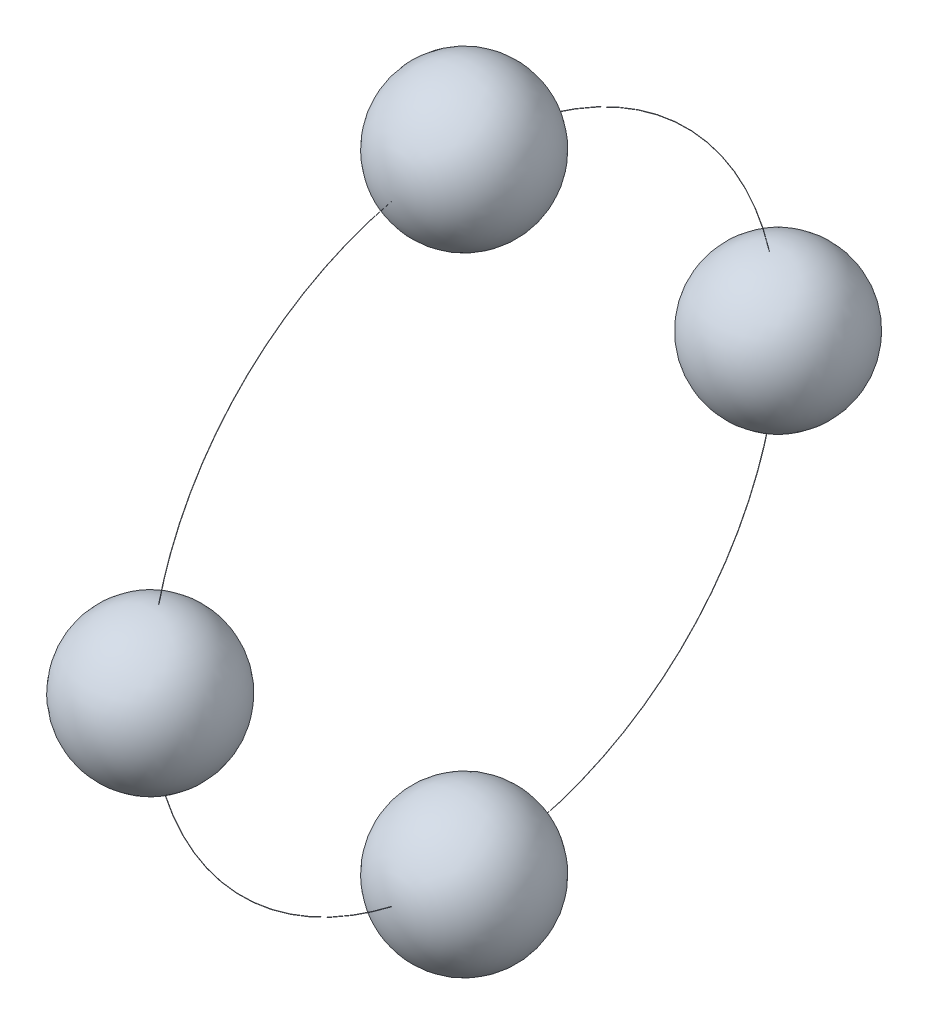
ISO-10303-21;
HEADER;
FILE_DESCRIPTION(('STEP AP214'),'2;1');
FILE_NAME('part.step','',(''),(''),'','','');
FILE_SCHEMA(('AUTOMOTIVE_DESIGN { 1 0 10303 214 1 1 1 1 }'));
ENDSEC;
DATA;
#1=APPLICATION_CONTEXT('core data for automotive mechanical design processes');
#2=APPLICATION_PROTOCOL_DEFINITION('international standard','automotive_design',2000,#1);
#3=PRODUCT_CONTEXT('',#1,'mechanical');
#4=PRODUCT('Part','Part','',(#3));
#5=PRODUCT_RELATED_PRODUCT_CATEGORY('part','',(#4));
#6=PRODUCT_DEFINITION_FORMATION('','',#4);
#7=PRODUCT_DEFINITION_CONTEXT('part definition',#1,'design');
#8=PRODUCT_DEFINITION('design','',#6,#7);
#9=PRODUCT_DEFINITION_SHAPE('','',#8);
#10=(LENGTH_UNIT() NAMED_UNIT(*) SI_UNIT(.MILLI.,.METRE.));
#11=(NAMED_UNIT(*) PLANE_ANGLE_UNIT() SI_UNIT($,.RADIAN.));
#12=(NAMED_UNIT(*) SI_UNIT($,.STERADIAN.) SOLID_ANGLE_UNIT());
#13=UNCERTAINTY_MEASURE_WITH_UNIT(LENGTH_MEASURE(1.E-05),#10,'distance_accuracy_value','');
#14=(GEOMETRIC_REPRESENTATION_CONTEXT(3) GLOBAL_UNCERTAINTY_ASSIGNED_CONTEXT((#13)) GLOBAL_UNIT_ASSIGNED_CONTEXT((#10,
#11,#12)) REPRESENTATION_CONTEXT('',''));
#15=CARTESIAN_POINT('',(0.,0.,0.));
#16=DIRECTION('',(0.,0.,1.));
#17=DIRECTION('',(1.,0.,0.));
#18=AXIS2_PLACEMENT_3D('',#15,#16,#17);
#19=CARTESIAN_POINT('',(4.,0.,0.));
#20=DIRECTION('',(1.,0.,0.));
#21=DIRECTION('',(0.,-1.,0.));
#22=AXIS2_PLACEMENT_3D('',#19,#20,#21);
#23=TOROIDAL_SURFACE('',#22,8.5,0.003969);
#24=CARTESIAN_POINT('',(3.99840292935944,-1.97135524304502,-8.27197323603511));
#25=CARTESIAN_POINT('',(3.99819881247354,-1.97134469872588,-8.27188350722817));
#26=CARTESIAN_POINT('',(3.99800220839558,-1.9713321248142,-8.27177650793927));
#27=CARTESIAN_POINT('',(3.99762975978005,-1.97130328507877,-8.27153109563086));
#28=CARTESIAN_POINT('',(3.9974539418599,-1.97128701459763,-8.2713926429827));
#29=CARTESIAN_POINT('',(3.99712828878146,-1.97125127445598,-8.27108851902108));
#30=CARTESIAN_POINT('',(3.99697843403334,-1.97123180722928,-8.27092286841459));
#31=CARTESIAN_POINT('',(3.99670873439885,-1.97119023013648,-8.27056908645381));
#32=CARTESIAN_POINT('',(3.99658888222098,-1.97116812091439,-8.27038096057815));
#33=CARTESIAN_POINT('',(3.99638187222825,-1.97112176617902,-8.26998653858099));
#34=CARTESIAN_POINT('',(3.99629488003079,-1.97109751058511,-8.26978015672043));
#35=CARTESIAN_POINT('',(3.99615679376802,-1.97104764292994,-8.26935585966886));
#36=CARTESIAN_POINT('',(3.99610570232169,-1.97102203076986,-8.26913794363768));
#37=CARTESIAN_POINT('',(3.99604061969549,-1.97097002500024,-8.26869547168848));
#38=CARTESIAN_POINT('',(3.99602683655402,-1.9709436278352,-8.26847088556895));
#39=CARTESIAN_POINT('',(3.99603734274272,-1.97089093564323,-8.26802259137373));
#40=CARTESIAN_POINT('',(3.9960616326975,-1.97086464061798,-8.26779888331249));
#41=CARTESIAN_POINT('',(3.99614771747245,-1.97081284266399,-8.26735821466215));
#42=CARTESIAN_POINT('',(3.9962095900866,-1.9707873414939,-8.26714126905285));
#43=CARTESIAN_POINT('',(3.99636921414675,-1.97073791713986,-8.26672080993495));
#44=CARTESIAN_POINT('',(3.9964669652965,-1.97071399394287,-8.26651729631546));
#45=CARTESIAN_POINT('',(3.99669537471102,-1.97066846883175,-8.26613002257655));
#46=CARTESIAN_POINT('',(3.9968259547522,-1.97064686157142,-8.265946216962));
#47=CARTESIAN_POINT('',(3.99711649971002,-1.97060653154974,-8.26560314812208));
#48=CARTESIAN_POINT('',(3.99727646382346,-1.97058780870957,-8.26544388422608));
#49=CARTESIAN_POINT('',(3.99762026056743,-1.97055389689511,-8.26515542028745));
#50=CARTESIAN_POINT('',(3.99780394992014,-1.97053868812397,-8.26502605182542));
#51=CARTESIAN_POINT('',(3.99819070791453,-1.97051211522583,-8.26480002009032));
#52=CARTESIAN_POINT('',(3.99839377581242,-1.97050075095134,-8.26470335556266));
#53=CARTESIAN_POINT('',(3.99881207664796,-1.97048226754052,-8.2645461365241));
#54=CARTESIAN_POINT('',(3.99902721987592,-1.97047512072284,-8.26448534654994));
#55=CARTESIAN_POINT('',(3.99946474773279,-1.97046516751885,-8.26440068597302));
#56=CARTESIAN_POINT('',(3.99968713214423,-1.97046236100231,-8.26437681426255));
#57=CARTESIAN_POINT('',(4.00013174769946,-1.97046117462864,-8.26436672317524));
#58=CARTESIAN_POINT('',(4.00035397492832,-1.97046277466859,-8.26438033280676));
#59=CARTESIAN_POINT('',(4.00079296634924,-1.97047031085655,-8.26444443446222));
#60=CARTESIAN_POINT('',(4.00100973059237,-1.970476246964,-8.26449492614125));
#61=CARTESIAN_POINT('',(4.00143155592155,-1.97049227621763,-8.26463126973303));
#62=CARTESIAN_POINT('',(4.00163662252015,-1.97050236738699,-8.2647171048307));
#63=CARTESIAN_POINT('',(4.00202941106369,-1.97052641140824,-8.26492162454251));
#64=CARTESIAN_POINT('',(4.00221713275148,-1.97054036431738,-8.26504030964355));
#65=CARTESIAN_POINT('',(4.0025706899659,-1.97057178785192,-8.26530760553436));
#66=CARTESIAN_POINT('',(4.00273643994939,-1.97058927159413,-8.26545632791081));
#67=CARTESIAN_POINT('',(4.0030406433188,-1.97062722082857,-8.26577914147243));
#68=CARTESIAN_POINT('',(4.00317909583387,-1.97064768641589,-8.26595323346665));
#69=CARTESIAN_POINT('',(4.00342572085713,-1.97069115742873,-8.26632302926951));
#70=CARTESIAN_POINT('',(4.00353369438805,-1.97071417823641,-8.26651886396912));
#71=CARTESIAN_POINT('',(4.00371524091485,-1.9707619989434,-8.26692567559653));
#72=CARTESIAN_POINT('',(4.0037888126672,-1.970786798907,-8.26713665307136));
#73=CARTESIAN_POINT('',(4.00389991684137,-1.97083763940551,-8.26756917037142));
#74=CARTESIAN_POINT('',(4.00393722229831,-1.97086368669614,-8.26779076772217));
#75=CARTESIAN_POINT('',(4.00397398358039,-1.97091614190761,-8.2682370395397));
#76=CARTESIAN_POINT('',(4.00397343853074,-1.97094254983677,-8.26846171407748));
#77=CARTESIAN_POINT('',(4.00393444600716,-1.97099507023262,-8.26890855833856));
#78=CARTESIAN_POINT('',(4.00389587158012,-1.97102118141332,-8.26913071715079));
#79=CARTESIAN_POINT('',(4.00378168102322,-1.9710722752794,-8.26956544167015));
#80=CARTESIAN_POINT('',(4.00370606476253,-1.97109725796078,-8.26977800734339));
#81=CARTESIAN_POINT('',(4.00351995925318,-1.97114535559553,-8.27018725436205));
#82=CARTESIAN_POINT('',(4.00340950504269,-1.97116847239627,-8.27038395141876));
#83=CARTESIAN_POINT('',(4.00315675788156,-1.97121219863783,-8.27075601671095));
#84=CARTESIAN_POINT('',(4.00301446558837,-1.9712328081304,-8.27093138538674));
#85=CARTESIAN_POINT('',(4.00270280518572,-1.97127082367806,-8.2712548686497));
#86=CARTESIAN_POINT('',(4.00253357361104,-1.97128824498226,-8.27140311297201));
#87=CARTESIAN_POINT('',(4.00217231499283,-1.97131949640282,-8.27166904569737));
#88=CARTESIAN_POINT('',(4.0019802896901,-1.97133332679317,-8.27178673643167));
#89=CARTESIAN_POINT('',(4.00158029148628,-1.97135690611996,-8.27198738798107));
#90=CARTESIAN_POINT('',(4.00137243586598,-1.97136668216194,-8.27207057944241));
#91=CARTESIAN_POINT('',(4.00094550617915,-1.97138199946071,-8.2722009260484));
#92=CARTESIAN_POINT('',(4.00072642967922,-1.97138753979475,-8.2722480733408));
#93=CARTESIAN_POINT('',(4.00028453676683,-1.97139420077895,-8.27230475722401));
#94=CARTESIAN_POINT('',(4.00006174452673,-1.971395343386,-8.27231448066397));
#95=CARTESIAN_POINT('',(3.99961788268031,-1.97139323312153,-8.27229652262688));
#96=CARTESIAN_POINT('',(3.99939681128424,-1.97138998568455,-8.27226888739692));
#97=CARTESIAN_POINT('',(3.99904640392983,-1.97138129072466,-8.27219489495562));
#98=CARTESIAN_POINT('',(3.99891453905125,-1.97137717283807,-8.2721598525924));
#99=CARTESIAN_POINT('',(3.99865515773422,-1.97136737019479,-8.27207643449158));
#100=CARTESIAN_POINT('',(3.99852764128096,-1.97136168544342,-8.27202805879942));
#101=CARTESIAN_POINT('',(3.99840292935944,-1.97135524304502,-8.27197323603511));
#102=B_SPLINE_CURVE_WITH_KNOTS('',3,(#24,#25,#26,#27,#28,#29,#30,#31,#32,#33,#34,#35,#36,#37,
#38,#39,#40,#41,#42,#43,#44,#45,#46,#47,#48,#49,#50,#51,#52,#53,#54,#55,#56,#57,#58,#59,#60,#61,
#62,#63,#64,#65,#66,#67,#68,#69,#70,#71,#72,#73,#74,#75,#76,#77,#78,#79,#80,#81,#82,#83,#84,#85,
#86,#87,#88,#89,#90,#91,#92,#93,#94,#95,#96,#97,#98,#99,#100,#101),.UNSPECIFIED.,.T.,.F.,(4,2,2,
2,2,2,2,2,2,2,2,2,2,2,2,2,2,2,2,2,2,2,2,2,2,2,2,2,2,2,2,2,2,2,2,2,2,2,4),(0.,
0.000669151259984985,0.00133915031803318,0.00200864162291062,0.00267797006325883,
0.00335062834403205,0.00402333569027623,0.00469978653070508,0.00537624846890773,
0.00605411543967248,0.00673197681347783,0.00740823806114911,0.0080844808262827,
0.00875681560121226,0.00942912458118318,0.0100969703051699,0.010764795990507,0.0114295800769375,
0.0120943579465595,0.0127588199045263,0.0134232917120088,0.0140902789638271,0.0147572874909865,
0.015428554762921,0.016099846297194,0.0167753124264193,0.0174507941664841,0.018128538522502,
0.0188062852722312,0.0194833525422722,0.0201604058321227,0.0208341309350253,0.021507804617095,
0.0221768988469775,0.0228461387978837,0.0235120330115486,0.0241771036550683,0.0245859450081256,
0.0249947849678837),.UNSPECIFIED.);
#103=CARTESIAN_POINT('',(3.99840292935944,-1.97135524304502,-8.27197323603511));
#104=VERTEX_POINT('',#103);
#105=EDGE_CURVE('E10',#104,#104,#102,.T.);
#106=ORIENTED_EDGE('',*,*,#105,.F.);
#107=EDGE_LOOP('',(#106));
#108=FACE_BOUND('',#107,.T.);
#109=CARTESIAN_POINT('',(3.99840292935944,-8.27197323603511,-1.97135524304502));
#110=CARTESIAN_POINT('',(3.99860560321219,-8.27206230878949,-1.97136571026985));
#111=CARTESIAN_POINT('',(3.99881597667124,-8.27213448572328,-1.97137419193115));
#112=CARTESIAN_POINT('',(3.99924610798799,-8.27224279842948,-1.97138691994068));
#113=CARTESIAN_POINT('',(3.9994658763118,-8.27227889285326,-1.97139116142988));
#114=CARTESIAN_POINT('',(3.99990832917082,-8.27231387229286,-1.97139527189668));
#115=CARTESIAN_POINT('',(4.00013101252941,-8.27231277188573,-1.97139514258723));
#116=CARTESIAN_POINT('',(4.00057296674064,-8.27227342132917,-1.97139051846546));
#117=CARTESIAN_POINT('',(4.00079223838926,-8.27223517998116,-1.97138602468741));
#118=CARTESIAN_POINT('',(4.00122107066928,-8.27212273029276,-1.97137281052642));
#119=CARTESIAN_POINT('',(4.00143063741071,-8.27204854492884,-1.97136409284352));
#120=CARTESIAN_POINT('',(4.00183431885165,-8.27186638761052,-1.97134268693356));
#121=CARTESIAN_POINT('',(4.00202843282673,-8.27175841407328,-1.97132999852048));
#122=CARTESIAN_POINT('',(4.002396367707,-8.2715114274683,-1.97130097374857));
#123=CARTESIAN_POINT('',(4.00257012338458,-8.27137231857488,-1.97128462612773));
#124=CARTESIAN_POINT('',(4.00289183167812,-8.27106726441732,-1.97124877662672));
#125=CARTESIAN_POINT('',(4.00303978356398,-8.27090131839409,-1.97122927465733));
#126=CARTESIAN_POINT('',(4.00330666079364,-8.27054622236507,-1.97118754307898));
#127=CARTESIAN_POINT('',(4.00342540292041,-8.27035693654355,-1.97116529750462));
#128=CARTESIAN_POINT('',(4.00362944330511,-8.26996135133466,-1.97111880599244));
#129=CARTESIAN_POINT('',(4.00371474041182,-8.26975505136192,-1.97109455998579));
#130=CARTESIAN_POINT('',(4.00385002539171,-8.2693298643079,-1.9710445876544));
#131=CARTESIAN_POINT('',(4.00389978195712,-8.26911090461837,-1.97101885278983));
#132=CARTESIAN_POINT('',(4.00396173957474,-8.26866780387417,-1.97096677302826));
#133=CARTESIAN_POINT('',(4.00397393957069,-8.26844366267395,-1.97094042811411));
#134=CARTESIAN_POINT('',(4.00396042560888,-8.26799561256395,-1.97088776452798));
#135=CARTESIAN_POINT('',(4.00393456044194,-8.26777170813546,-1.97086144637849));
#136=CARTESIAN_POINT('',(4.00384534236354,-8.26733138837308,-1.97080968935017));
#137=CARTESIAN_POINT('',(4.00378198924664,-8.26711497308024,-1.97078425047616));
#138=CARTESIAN_POINT('',(4.00361954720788,-8.26669585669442,-1.97073498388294));
#139=CARTESIAN_POINT('',(4.00352046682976,-8.26649315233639,-1.97071115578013));
#140=CARTESIAN_POINT('',(4.00328930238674,-8.26610723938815,-1.97066579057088));
#141=CARTESIAN_POINT('',(4.0031572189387,-8.26592403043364,-1.97064425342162));
#142=CARTESIAN_POINT('',(4.00286438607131,-8.26558319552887,-1.97060418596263));
#143=CARTESIAN_POINT('',(4.00270376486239,-8.2654254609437,-1.97058564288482));
#144=CARTESIAN_POINT('',(4.00235798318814,-8.26513922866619,-1.97055199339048));
#145=CARTESIAN_POINT('',(4.00217282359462,-8.26501072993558,-1.9705368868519));
#146=CARTESIAN_POINT('',(4.00178453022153,-8.26478752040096,-1.97051064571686));
#147=CARTESIAN_POINT('',(4.00158152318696,-8.26469259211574,-1.97049948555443));
#148=CARTESIAN_POINT('',(4.00116227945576,-8.26453816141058,-1.97048132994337));
#149=CARTESIAN_POINT('',(4.00094604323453,-8.26447865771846,-1.9704743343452));
#150=CARTESIAN_POINT('',(4.00050784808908,-8.2643970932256,-1.97046474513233));
#151=CARTESIAN_POINT('',(4.00028593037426,-8.26437481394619,-1.97046212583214));
#152=CARTESIAN_POINT('',(3.99984148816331,-8.26436767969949,-1.97046128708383));
#153=CARTESIAN_POINT('',(3.99961896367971,-8.2643828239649,-1.97046306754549));
#154=CARTESIAN_POINT('',(3.99918022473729,-8.26444999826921,-1.97047096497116));
#155=CARTESIAN_POINT('',(3.99896399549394,-8.26450193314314,-1.97047707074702));
#156=CARTESIAN_POINT('',(3.99854336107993,-8.26464105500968,-1.97049342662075));
#157=CARTESIAN_POINT('',(3.99833895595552,-8.26472824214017,-1.97050367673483));
#158=CARTESIAN_POINT('',(3.99794733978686,-8.26493551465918,-1.97052804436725));
#159=CARTESIAN_POINT('',(3.9977601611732,-8.26505566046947,-1.97054216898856));
#160=CARTESIAN_POINT('',(3.99740862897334,-8.26532529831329,-1.9705738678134));
#161=CARTESIAN_POINT('',(3.99724427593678,-8.2654747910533,-1.97059144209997));
#162=CARTESIAN_POINT('',(3.99694208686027,-8.26579973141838,-1.9706296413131));
#163=CARTESIAN_POINT('',(3.99680439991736,-8.26597531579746,-1.97065028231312));
#164=CARTESIAN_POINT('',(3.99656042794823,-8.26634682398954,-1.9706939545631));
#165=CARTESIAN_POINT('',(3.99645414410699,-8.26654274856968,-1.97071698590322));
#166=CARTESIAN_POINT('',(3.99627525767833,-8.26695077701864,-1.97076494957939));
#167=CARTESIAN_POINT('',(3.99620288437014,-8.26716298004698,-1.97078989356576));
#168=CARTESIAN_POINT('',(3.99609483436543,-8.26759641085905,-1.97084084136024));
#169=CARTESIAN_POINT('',(3.99605915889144,-8.26781763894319,-1.97086684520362));
#170=CARTESIAN_POINT('',(3.99602538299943,-8.2682640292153,-1.97091931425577));
#171=CARTESIAN_POINT('',(3.99602747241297,-8.26848920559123,-1.97094578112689));
#172=CARTESIAN_POINT('',(3.99606963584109,-8.26893601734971,-1.97099829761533));
#173=CARTESIAN_POINT('',(3.99610970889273,-8.26915765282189,-1.97102434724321));
#174=CARTESIAN_POINT('',(3.99622680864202,-8.26959133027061,-1.97107531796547));
#175=CARTESIAN_POINT('',(3.99630387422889,-8.2698033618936,-1.97110023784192));
#176=CARTESIAN_POINT('',(3.99649289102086,-8.27021156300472,-1.97114821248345));
#177=CARTESIAN_POINT('',(3.99660485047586,-8.27040772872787,-1.97117126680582));
#178=CARTESIAN_POINT('',(3.99686016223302,-8.27077793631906,-1.97121477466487));
#179=CARTESIAN_POINT('',(3.99700342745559,-8.27095203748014,-1.97123523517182));
#180=CARTESIAN_POINT('',(3.99731742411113,-8.27127352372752,-1.97127301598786));
#181=CARTESIAN_POINT('',(3.99748812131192,-8.27142094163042,-1.97129034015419));
#182=CARTESIAN_POINT('',(3.99778418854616,-8.27163565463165,-1.97131557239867));
#183=CARTESIAN_POINT('',(3.99790277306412,-8.27171234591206,-1.97132458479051));
#184=CARTESIAN_POINT('',(3.99814750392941,-8.27185272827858,-1.97134108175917));
#185=CARTESIAN_POINT('',(3.99827365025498,-8.27191641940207,-1.97134856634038));
#186=CARTESIAN_POINT('',(3.99840292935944,-8.27197323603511,-1.97135524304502));
#187=B_SPLINE_CURVE_WITH_KNOTS('',3,(#109,#110,#111,#112,#113,#114,#115,#116,#117,#118,#119,
#120,#121,#122,#123,#124,#125,#126,#127,#128,#129,#130,#131,#132,#133,#134,#135,#136,#137,#138,
#139,#140,#141,#142,#143,#144,#145,#146,#147,#148,#149,#150,#151,#152,#153,#154,#155,#156,#157,
#158,#159,#160,#161,#162,#163,#164,#165,#166,#167,#168,#169,#170,#171,#172,#173,#174,#175,#176,
#177,#178,#179,#180,#181,#182,#183,#184,#185,#186),.UNSPECIFIED.,.T.,.F.,(4,2,2,2,2,2,2,2,2,2,2,
2,2,2,2,2,2,2,2,2,2,2,2,2,2,2,2,2,2,2,2,2,2,2,2,2,2,2,4),(0.,0.000664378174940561,
0.00132951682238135,0.0019943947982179,0.00265911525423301,0.00332341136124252,
0.00398773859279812,0.00465413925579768,0.00532055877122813,0.00599105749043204,
0.00666157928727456,0.00733642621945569,0.00801129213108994,0.00868884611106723,
0.00936640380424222,0.0100437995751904,0.0107211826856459,0.0113955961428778,0.012069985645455,
0.0127399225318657,0.0134098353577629,0.0140758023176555,0.0147417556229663,0.0154059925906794,
0.0160702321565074,0.0167356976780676,0.0174011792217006,0.018070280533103,0.0187394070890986,
0.01941299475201,0.020086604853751,0.0207636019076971,0.0214405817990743,0.0221182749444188,
0.0227961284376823,0.0234721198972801,0.0241472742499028,0.02457106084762,0.0249948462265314),.UNSPECIFIED.);
#188=CARTESIAN_POINT('',(3.99840292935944,-8.27197323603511,-1.97135524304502));
#189=VERTEX_POINT('',#188);
#190=EDGE_CURVE('E36',#189,#189,#187,.T.);
#191=ORIENTED_EDGE('',*,*,#190,.F.);
#192=EDGE_LOOP('',(#191));
#193=FACE_BOUND('',#192,.T.);
#194=ADVANCED_FACE('F14',(#108,#193),#23,.T.);
#195=CARTESIAN_POINT('',(3.99840292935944,1.97135524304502,-8.27197323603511));
#196=CARTESIAN_POINT('',(3.99860560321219,1.97136571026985,-8.27206230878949));
#197=CARTESIAN_POINT('',(3.99881597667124,1.97137419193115,-8.27213448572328));
#198=CARTESIAN_POINT('',(3.99924610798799,1.97138691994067,-8.27224279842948));
#199=CARTESIAN_POINT('',(3.9994658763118,1.97139116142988,-8.27227889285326));
#200=CARTESIAN_POINT('',(3.99990832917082,1.97139527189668,-8.27231387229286));
#201=CARTESIAN_POINT('',(4.00013101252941,1.97139514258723,-8.27231277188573));
#202=CARTESIAN_POINT('',(4.00057296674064,1.97139051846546,-8.27227342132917));
#203=CARTESIAN_POINT('',(4.00079223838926,1.97138602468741,-8.27223517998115));
#204=CARTESIAN_POINT('',(4.00122107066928,1.97137281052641,-8.27212273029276));
#205=CARTESIAN_POINT('',(4.00143063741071,1.97136409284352,-8.27204854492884));
#206=CARTESIAN_POINT('',(4.00183431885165,1.97134268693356,-8.27186638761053));
#207=CARTESIAN_POINT('',(4.00202843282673,1.97132999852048,-8.27175841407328));
#208=CARTESIAN_POINT('',(4.002396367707,1.97130097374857,-8.2715114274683));
#209=CARTESIAN_POINT('',(4.00257012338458,1.97128462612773,-8.27137231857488));
#210=CARTESIAN_POINT('',(4.00289183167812,1.97124877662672,-8.27106726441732));
#211=CARTESIAN_POINT('',(4.00303978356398,1.97122927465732,-8.27090131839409));
#212=CARTESIAN_POINT('',(4.00330666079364,1.97118754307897,-8.27054622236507));
#213=CARTESIAN_POINT('',(4.0034254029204,1.97116529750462,-8.27035693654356));
#214=CARTESIAN_POINT('',(4.00362944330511,1.97111880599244,-8.26996135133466));
#215=CARTESIAN_POINT('',(4.00371474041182,1.97109455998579,-8.26975505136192));
#216=CARTESIAN_POINT('',(4.00385002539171,1.9710445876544,-8.2693298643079));
#217=CARTESIAN_POINT('',(4.00389978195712,1.97101885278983,-8.26911090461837));
#218=CARTESIAN_POINT('',(4.00396173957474,1.97096677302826,-8.26866780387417));
#219=CARTESIAN_POINT('',(4.00397393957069,1.97094042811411,-8.26844366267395));
#220=CARTESIAN_POINT('',(4.00396042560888,1.97088776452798,-8.26799561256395));
#221=CARTESIAN_POINT('',(4.00393456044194,1.97086144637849,-8.26777170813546));
#222=CARTESIAN_POINT('',(4.00384534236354,1.97080968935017,-8.26733138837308));
#223=CARTESIAN_POINT('',(4.00378198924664,1.97078425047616,-8.26711497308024));
#224=CARTESIAN_POINT('',(4.00361954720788,1.97073498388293,-8.26669585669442));
#225=CARTESIAN_POINT('',(4.00352046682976,1.97071115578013,-8.26649315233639));
#226=CARTESIAN_POINT('',(4.00328930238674,1.97066579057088,-8.26610723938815));
#227=CARTESIAN_POINT('',(4.0031572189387,1.97064425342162,-8.26592403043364));
#228=CARTESIAN_POINT('',(4.00286438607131,1.97060418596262,-8.26558319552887));
#229=CARTESIAN_POINT('',(4.00270376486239,1.97058564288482,-8.2654254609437));
#230=CARTESIAN_POINT('',(4.00235798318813,1.97055199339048,-8.26513922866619));
#231=CARTESIAN_POINT('',(4.00217282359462,1.9705368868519,-8.26501072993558));
#232=CARTESIAN_POINT('',(4.00178453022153,1.97051064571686,-8.26478752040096));
#233=CARTESIAN_POINT('',(4.00158152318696,1.97049948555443,-8.26469259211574));
#234=CARTESIAN_POINT('',(4.00116227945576,1.97048132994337,-8.26453816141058));
#235=CARTESIAN_POINT('',(4.00094604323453,1.9704743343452,-8.26447865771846));
#236=CARTESIAN_POINT('',(4.00050784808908,1.97046474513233,-8.2643970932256));
#237=CARTESIAN_POINT('',(4.00028593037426,1.97046212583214,-8.26437481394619));
#238=CARTESIAN_POINT('',(3.99984148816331,1.97046128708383,-8.26436767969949));
#239=CARTESIAN_POINT('',(3.99961896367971,1.97046306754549,-8.2643828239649));
#240=CARTESIAN_POINT('',(3.99918022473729,1.97047096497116,-8.26444999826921));
#241=CARTESIAN_POINT('',(3.99896399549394,1.97047707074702,-8.26450193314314));
#242=CARTESIAN_POINT('',(3.99854336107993,1.97049342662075,-8.26464105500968));
#243=CARTESIAN_POINT('',(3.99833895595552,1.97050367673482,-8.26472824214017));
#244=CARTESIAN_POINT('',(3.99794733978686,1.97052804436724,-8.26493551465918));
#245=CARTESIAN_POINT('',(3.9977601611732,1.97054216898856,-8.26505566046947));
#246=CARTESIAN_POINT('',(3.99740862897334,1.9705738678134,-8.26532529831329));
#247=CARTESIAN_POINT('',(3.99724427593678,1.97059144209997,-8.2654747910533));
#248=CARTESIAN_POINT('',(3.99694208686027,1.9706296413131,-8.26579973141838));
#249=CARTESIAN_POINT('',(3.99680439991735,1.97065028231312,-8.26597531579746));
#250=CARTESIAN_POINT('',(3.99656042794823,1.9706939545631,-8.26634682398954));
#251=CARTESIAN_POINT('',(3.99645414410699,1.97071698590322,-8.26654274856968));
#252=CARTESIAN_POINT('',(3.99627525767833,1.97076494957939,-8.26695077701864));
#253=CARTESIAN_POINT('',(3.99620288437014,1.97078989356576,-8.26716298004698));
#254=CARTESIAN_POINT('',(3.99609483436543,1.97084084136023,-8.26759641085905));
#255=CARTESIAN_POINT('',(3.99605915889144,1.97086684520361,-8.26781763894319));
#256=CARTESIAN_POINT('',(3.99602538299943,1.97091931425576,-8.2682640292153));
#257=CARTESIAN_POINT('',(3.99602747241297,1.97094578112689,-8.26848920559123));
#258=CARTESIAN_POINT('',(3.99606963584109,1.97099829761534,-8.26893601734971));
#259=CARTESIAN_POINT('',(3.99610970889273,1.97102434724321,-8.26915765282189));
#260=CARTESIAN_POINT('',(3.99622680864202,1.97107531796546,-8.26959133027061));
#261=CARTESIAN_POINT('',(3.99630387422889,1.97110023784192,-8.2698033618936));
#262=CARTESIAN_POINT('',(3.99649289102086,1.97114821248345,-8.27021156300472));
#263=CARTESIAN_POINT('',(3.99660485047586,1.97117126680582,-8.27040772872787));
#264=CARTESIAN_POINT('',(3.99686016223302,1.97121477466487,-8.27077793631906));
#265=CARTESIAN_POINT('',(3.99700342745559,1.97123523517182,-8.27095203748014));
#266=CARTESIAN_POINT('',(3.99731742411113,1.97127301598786,-8.27127352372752));
#267=CARTESIAN_POINT('',(3.99748812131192,1.97129034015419,-8.27142094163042));
#268=CARTESIAN_POINT('',(3.99778418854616,1.97131557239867,-8.27163565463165));
#269=CARTESIAN_POINT('',(3.99790277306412,1.97132458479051,-8.27171234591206));
#270=CARTESIAN_POINT('',(3.99814750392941,1.97134108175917,-8.27185272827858));
#271=CARTESIAN_POINT('',(3.99827365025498,1.97134856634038,-8.27191641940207));
#272=CARTESIAN_POINT('',(3.99840292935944,1.97135524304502,-8.27197323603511));
#273=B_SPLINE_CURVE_WITH_KNOTS('',3,(#195,#196,#197,#198,#199,#200,#201,#202,#203,#204,#205,
#206,#207,#208,#209,#210,#211,#212,#213,#214,#215,#216,#217,#218,#219,#220,#221,#222,#223,#224,
#225,#226,#227,#228,#229,#230,#231,#232,#233,#234,#235,#236,#237,#238,#239,#240,#241,#242,#243,
#244,#245,#246,#247,#248,#249,#250,#251,#252,#253,#254,#255,#256,#257,#258,#259,#260,#261,#262,
#263,#264,#265,#266,#267,#268,#269,#270,#271,#272),.UNSPECIFIED.,.T.,.F.,(4,2,2,2,2,2,2,2,2,2,2,
2,2,2,2,2,2,2,2,2,2,2,2,2,2,2,2,2,2,2,2,2,2,2,2,2,2,2,4),(0.,0.000664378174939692,
0.00132951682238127,0.00199439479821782,0.002659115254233,0.00332341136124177,
0.00398773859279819,0.0046541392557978,0.0053205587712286,0.00599105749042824,
0.00666157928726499,0.00733642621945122,0.00801129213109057,0.00868884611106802,
0.0093664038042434,0.0100437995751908,0.0107211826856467,0.0113955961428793,0.0120699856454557,
0.0127399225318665,0.0134098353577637,0.0140758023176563,0.0147417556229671,0.0154059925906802,
0.0160702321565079,0.0167356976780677,0.0174011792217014,0.0180702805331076,0.0187394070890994,
0.0194129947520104,0.020086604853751,0.0207636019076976,0.0214405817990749,0.0221182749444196,
0.0227961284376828,0.0234721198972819,0.0241472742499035,0.0245710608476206,0.024994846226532),.UNSPECIFIED.);
#274=CARTESIAN_POINT('',(3.99840292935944,1.97135524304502,-8.27197323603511));
#275=VERTEX_POINT('',#274);
#276=EDGE_CURVE('E27',#275,#275,#273,.T.);
#277=ORIENTED_EDGE('',*,*,#276,.F.);
#278=EDGE_LOOP('',(#277));
#279=FACE_BOUND('',#278,.T.);
#280=CARTESIAN_POINT('',(3.99893775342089,8.26451550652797,-1.9704786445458));
#281=CARTESIAN_POINT('',(3.99915109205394,8.2644562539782,-1.97047167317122));
#282=CARTESIAN_POINT('',(3.99936962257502,8.26441485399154,-1.97046682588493));
#283=CARTESIAN_POINT('',(3.99981075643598,8.26436904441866,-1.97046145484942));
#284=CARTESIAN_POINT('',(4.00003336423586,8.2643646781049,-1.970460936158));
#285=CARTESIAN_POINT('',(4.00047606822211,8.26439315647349,-1.97046428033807));
#286=CARTESIAN_POINT('',(4.00069616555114,8.26442598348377,-1.97046814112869));
#287=CARTESIAN_POINT('',(4.00112763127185,8.26452784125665,-1.97048011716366));
#288=CARTESIAN_POINT('',(4.00133900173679,8.26459686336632,-1.97048823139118));
#289=CARTESIAN_POINT('',(4.0017472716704,8.26476914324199,-1.97050848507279));
#290=CARTESIAN_POINT('',(4.00194416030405,8.26487242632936,-1.97052062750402));
#291=CARTESIAN_POINT('',(4.00231779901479,8.26511021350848,-1.9705485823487));
#292=CARTESIAN_POINT('',(4.00249454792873,8.26524471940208,-1.97056439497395));
#293=CARTESIAN_POINT('',(4.00282378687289,8.26554177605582,-1.97059931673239));
#294=CARTESIAN_POINT('',(4.00297615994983,8.26570445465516,-1.97061844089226));
#295=CARTESIAN_POINT('',(4.00325146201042,8.26605276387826,-1.97065938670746));
#296=CARTESIAN_POINT('',(4.00337439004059,8.26623839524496,-1.97068120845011));
#297=CARTESIAN_POINT('',(4.00358817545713,8.26662865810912,-1.97072708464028));
#298=CARTESIAN_POINT('',(4.00367881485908,8.26683340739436,-1.97075115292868));
#299=CARTESIAN_POINT('',(4.00382441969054,8.26725505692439,-1.97080071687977));
#300=CARTESIAN_POINT('',(4.0038793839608,8.26747195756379,-1.9708262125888));
#301=CARTESIAN_POINT('',(4.00395236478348,8.26791308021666,-1.97087806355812));
#302=CARTESIAN_POINT('',(4.00397016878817,8.2681373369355,-1.9709044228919));
#303=CARTESIAN_POINT('',(4.00396771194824,8.2685856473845,-1.97095711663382));
#304=CARTESIAN_POINT('',(4.00394745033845,8.2688097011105,-1.97098345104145));
#305=CARTESIAN_POINT('',(4.00386931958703,8.26925178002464,-1.97103541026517));
#306=CARTESIAN_POINT('',(4.00381136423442,8.26946979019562,-1.97106103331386));
#307=CARTESIAN_POINT('',(4.00365934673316,8.26989302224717,-1.97111077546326));
#308=CARTESIAN_POINT('',(4.00356528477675,8.27009824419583,-1.97113489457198));
#309=CARTESIAN_POINT('',(4.00334388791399,8.27048957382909,-1.97118088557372));
#310=CARTESIAN_POINT('',(4.00321662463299,8.27067572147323,-1.97120276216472));
#311=CARTESIAN_POINT('',(4.00293227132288,8.27102400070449,-1.97124369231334));
#312=CARTESIAN_POINT('',(4.00277518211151,8.27118613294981,-1.97126274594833));
#313=CARTESIAN_POINT('',(4.00243657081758,8.27148078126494,-1.97129737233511));
#314=CARTESIAN_POINT('',(4.00225519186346,8.27161345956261,-1.97131296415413));
#315=CARTESIAN_POINT('',(4.00187245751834,8.27184645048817,-1.97134034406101));
#316=CARTESIAN_POINT('',(4.00167110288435,8.27194676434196,-1.97135213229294));
#317=CARTESIAN_POINT('',(4.00125557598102,8.27211148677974,-1.97137148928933));
#318=CARTESIAN_POINT('',(4.00104149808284,8.27217613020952,-1.97137908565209));
#319=CARTESIAN_POINT('',(4.00060543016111,8.27226861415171,-1.97138995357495));
#320=CARTESIAN_POINT('',(4.00038344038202,8.27229645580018,-1.97139322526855));
#321=CARTESIAN_POINT('',(3.9999389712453,8.27231446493,-1.97139534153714));
#322=CARTESIAN_POINT('',(3.99971649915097,8.27230480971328,-1.97139420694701));
#323=CARTESIAN_POINT('',(3.99927635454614,8.27224851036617,-1.97138759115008));
#324=CARTESIAN_POINT('',(3.99905868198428,8.27220186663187,-1.97138210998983));
#325=CARTESIAN_POINT('',(3.99863445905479,8.27207301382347,-1.97136696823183));
#326=CARTESIAN_POINT('',(3.99842790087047,8.27199083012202,-1.97135731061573));
#327=CARTESIAN_POINT('',(3.99803153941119,8.27179330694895,-1.97133409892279));
#328=CARTESIAN_POINT('',(3.99784173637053,8.27167796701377,-1.97132054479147));
#329=CARTESIAN_POINT('',(3.99748351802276,8.27141700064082,-1.97128987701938));
#330=CARTESIAN_POINT('',(3.99731518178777,8.27127126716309,-1.97127275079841));
#331=CARTESIAN_POINT('',(3.99700534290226,8.27095395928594,-1.97123546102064));
#332=CARTESIAN_POINT('',(3.99686384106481,8.27078238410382,-1.97121529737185));
#333=CARTESIAN_POINT('',(3.99661072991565,8.27041711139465,-1.97117236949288));
#334=CARTESIAN_POINT('',(3.99649931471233,8.2702232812,-1.9711495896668));
#335=CARTESIAN_POINT('',(3.99631059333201,8.26981988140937,-1.97110217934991));
#336=CARTESIAN_POINT('',(3.99623328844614,8.26961031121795,-1.97107754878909));
#337=CARTESIAN_POINT('',(3.99611449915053,8.26917996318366,-1.97102696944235));
#338=CARTESIAN_POINT('',(3.99607324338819,8.26895912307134,-1.97100101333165));
#339=CARTESIAN_POINT('',(3.99602850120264,8.26851369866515,-1.97094865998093));
#340=CARTESIAN_POINT('',(3.9960250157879,8.26828911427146,-1.97092226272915));
#341=CARTESIAN_POINT('',(3.99605596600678,8.26784172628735,-1.97086967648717));
#342=CARTESIAN_POINT('',(3.99609053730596,8.26761893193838,-1.97084348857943));
#343=CARTESIAN_POINT('',(3.99619687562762,8.26718228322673,-1.97079216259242));
#344=CARTESIAN_POINT('',(3.9962686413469,8.26696842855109,-1.9707670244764));
#345=CARTESIAN_POINT('',(3.99644732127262,8.26655594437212,-1.97071853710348));
#346=CARTESIAN_POINT('',(3.99655420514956,8.26635730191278,-1.97069518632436));
#347=CARTESIAN_POINT('',(3.9968002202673,8.26598071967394,-1.97065091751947));
#348=CARTESIAN_POINT('',(3.9969393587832,8.26580278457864,-1.97063000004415));
#349=CARTESIAN_POINT('',(3.9972452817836,8.26547359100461,-1.97059130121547));
#350=CARTESIAN_POINT('',(3.99741194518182,8.26532222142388,-1.97057350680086));
#351=CARTESIAN_POINT('',(3.99776852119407,8.26504979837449,-1.97054147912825));
#352=CARTESIAN_POINT('',(3.99795840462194,8.26492870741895,-1.97052724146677));
#353=CARTESIAN_POINT('',(3.99828122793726,8.26475944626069,-1.97050734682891));
#354=CARTESIAN_POINT('',(3.99840879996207,8.26470096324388,-1.97050047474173));
#355=CARTESIAN_POINT('',(3.99866947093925,8.2645977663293,-1.97048833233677));
#356=CARTESIAN_POINT('',(3.99880256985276,8.26455305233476,-1.97048306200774));
#357=CARTESIAN_POINT('',(3.99893775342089,8.26451550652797,-1.9704786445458));
#358=B_SPLINE_CURVE_WITH_KNOTS('',3,(#280,#281,#282,#283,#284,#285,#286,#287,#288,#289,#290,
#291,#292,#293,#294,#295,#296,#297,#298,#299,#300,#301,#302,#303,#304,#305,#306,#307,#308,#309,
#310,#311,#312,#313,#314,#315,#316,#317,#318,#319,#320,#321,#322,#323,#324,#325,#326,#327,#328,
#329,#330,#331,#332,#333,#334,#335,#336,#337,#338,#339,#340,#341,#342,#343,#344,#345,#346,#347,
#348,#349,#350,#351,#352,#353,#354,#355,#356,#357),.UNSPECIFIED.,.T.,.F.,(4,2,2,2,2,2,2,2,2,2,2,
2,2,2,2,2,2,2,2,2,2,2,2,2,2,2,2,2,2,2,2,2,2,2,2,2,2,2,4),(0.,0.00066406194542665,
0.00132889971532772,0.00199342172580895,0.00265778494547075,0.00332264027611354,
0.0039875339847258,0.00465552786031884,0.00532354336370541,0.00599598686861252,
0.00666845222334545,0.00734475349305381,0.00802106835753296,0.00869893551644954,
0.0093767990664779,0.0100532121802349,0.0107296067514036,0.0114021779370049,0.0120747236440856,
0.012742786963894,0.0134108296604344,0.0140757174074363,0.0147405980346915,0.0154050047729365,
0.0160694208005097,0.0167362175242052,0.017403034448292,0.0180740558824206,0.0187451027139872,
0.0194203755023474,0.0200956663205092,0.0207733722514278,0.0214510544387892,0.0221281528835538,
0.0228054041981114,0.0234797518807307,0.02415326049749,0.0245740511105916,0.0249948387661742),.UNSPECIFIED.);
#359=CARTESIAN_POINT('',(3.99893775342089,8.26451550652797,-1.9704786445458));
#360=VERTEX_POINT('',#359);
#361=EDGE_CURVE('E85',#360,#360,#358,.T.);
#362=ORIENTED_EDGE('',*,*,#361,.F.);
#363=EDGE_LOOP('',(#362));
#364=FACE_BOUND('',#363,.T.);
#365=ADVANCED_FACE('F110',(#279,#364),#23,.T.);
#366=CARTESIAN_POINT('',(3.99840292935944,-8.27197323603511,1.97135524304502));
#367=CARTESIAN_POINT('',(3.99819881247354,-8.27188350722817,1.97134469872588));
#368=CARTESIAN_POINT('',(3.99800220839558,-8.27177650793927,1.9713321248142));
#369=CARTESIAN_POINT('',(3.99762975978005,-8.27153109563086,1.97130328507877));
#370=CARTESIAN_POINT('',(3.9974539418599,-8.2713926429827,1.97128701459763));
#371=CARTESIAN_POINT('',(3.99712828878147,-8.27108851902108,1.97125127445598));
#372=CARTESIAN_POINT('',(3.99697843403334,-8.27092286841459,1.97123180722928));
#373=CARTESIAN_POINT('',(3.99670873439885,-8.27056908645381,1.97119023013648));
#374=CARTESIAN_POINT('',(3.99658888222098,-8.27038096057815,1.97116812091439));
#375=CARTESIAN_POINT('',(3.99638187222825,-8.26998653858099,1.97112176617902));
#376=CARTESIAN_POINT('',(3.99629488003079,-8.26978015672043,1.97109751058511));
#377=CARTESIAN_POINT('',(3.99615679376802,-8.26935585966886,1.97104764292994));
#378=CARTESIAN_POINT('',(3.99610570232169,-8.26913794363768,1.97102203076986));
#379=CARTESIAN_POINT('',(3.99604061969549,-8.26869547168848,1.97097002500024));
#380=CARTESIAN_POINT('',(3.99602683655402,-8.26847088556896,1.9709436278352));
#381=CARTESIAN_POINT('',(3.99603734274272,-8.26802259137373,1.97089093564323));
#382=CARTESIAN_POINT('',(3.9960616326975,-8.26779888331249,1.97086464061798));
#383=CARTESIAN_POINT('',(3.99614771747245,-8.26735821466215,1.97081284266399));
#384=CARTESIAN_POINT('',(3.9962095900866,-8.26714126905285,1.9707873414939));
#385=CARTESIAN_POINT('',(3.99636921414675,-8.26672080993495,1.97073791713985));
#386=CARTESIAN_POINT('',(3.9964669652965,-8.26651729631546,1.97071399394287));
#387=CARTESIAN_POINT('',(3.99669537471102,-8.26613002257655,1.97066846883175));
#388=CARTESIAN_POINT('',(3.9968259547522,-8.265946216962,1.97064686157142));
#389=CARTESIAN_POINT('',(3.99711649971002,-8.26560314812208,1.97060653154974));
#390=CARTESIAN_POINT('',(3.99727646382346,-8.26544388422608,1.97058780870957));
#391=CARTESIAN_POINT('',(3.99762026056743,-8.26515542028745,1.97055389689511));
#392=CARTESIAN_POINT('',(3.99780394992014,-8.26502605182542,1.97053868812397));
#393=CARTESIAN_POINT('',(3.99819070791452,-8.26480002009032,1.97051211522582));
#394=CARTESIAN_POINT('',(3.99839377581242,-8.26470335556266,1.97050075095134));
#395=CARTESIAN_POINT('',(3.99881207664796,-8.2645461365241,1.97048226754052));
#396=CARTESIAN_POINT('',(3.99902721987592,-8.26448534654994,1.97047512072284));
#397=CARTESIAN_POINT('',(3.99946474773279,-8.26440068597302,1.97046516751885));
#398=CARTESIAN_POINT('',(3.99968713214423,-8.26437681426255,1.9704623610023));
#399=CARTESIAN_POINT('',(4.00013174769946,-8.26436672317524,1.97046117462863));
#400=CARTESIAN_POINT('',(4.00035397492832,-8.26438033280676,1.97046277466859));
#401=CARTESIAN_POINT('',(4.00079296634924,-8.26444443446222,1.97047031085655));
#402=CARTESIAN_POINT('',(4.00100973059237,-8.26449492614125,1.970476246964));
#403=CARTESIAN_POINT('',(4.00143155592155,-8.26463126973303,1.97049227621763));
#404=CARTESIAN_POINT('',(4.00163662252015,-8.2647171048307,1.97050236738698));
#405=CARTESIAN_POINT('',(4.00202941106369,-8.26492162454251,1.97052641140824));
#406=CARTESIAN_POINT('',(4.00221713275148,-8.26504030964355,1.97054036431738));
#407=CARTESIAN_POINT('',(4.0025706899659,-8.26530760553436,1.97057178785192));
#408=CARTESIAN_POINT('',(4.00273643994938,-8.26545632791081,1.97058927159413));
#409=CARTESIAN_POINT('',(4.0030406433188,-8.26577914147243,1.97062722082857));
#410=CARTESIAN_POINT('',(4.00317909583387,-8.26595323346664,1.97064768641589));
#411=CARTESIAN_POINT('',(4.00342572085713,-8.2663230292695,1.97069115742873));
#412=CARTESIAN_POINT('',(4.00353369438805,-8.26651886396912,1.9707141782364));
#413=CARTESIAN_POINT('',(4.00371524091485,-8.26692567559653,1.9707619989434));
#414=CARTESIAN_POINT('',(4.0037888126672,-8.26713665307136,1.970786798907));
#415=CARTESIAN_POINT('',(4.00389991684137,-8.26756917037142,1.97083763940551));
#416=CARTESIAN_POINT('',(4.00393722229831,-8.26779076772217,1.97086368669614));
#417=CARTESIAN_POINT('',(4.00397398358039,-8.2682370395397,1.97091614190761));
#418=CARTESIAN_POINT('',(4.00397343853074,-8.26846171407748,1.97094254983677));
#419=CARTESIAN_POINT('',(4.00393444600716,-8.26890855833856,1.97099507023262));
#420=CARTESIAN_POINT('',(4.00389587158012,-8.26913071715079,1.97102118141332));
#421=CARTESIAN_POINT('',(4.00378168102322,-8.26956544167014,1.9710722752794));
#422=CARTESIAN_POINT('',(4.00370606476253,-8.26977800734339,1.97109725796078));
#423=CARTESIAN_POINT('',(4.00351995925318,-8.27018725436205,1.97114535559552));
#424=CARTESIAN_POINT('',(4.00340950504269,-8.27038395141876,1.97116847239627));
#425=CARTESIAN_POINT('',(4.00315675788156,-8.27075601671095,1.97121219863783));
#426=CARTESIAN_POINT('',(4.00301446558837,-8.27093138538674,1.9712328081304));
#427=CARTESIAN_POINT('',(4.00270280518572,-8.2712548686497,1.97127082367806));
#428=CARTESIAN_POINT('',(4.00253357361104,-8.27140311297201,1.97128824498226));
#429=CARTESIAN_POINT('',(4.00217231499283,-8.27166904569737,1.97131949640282));
#430=CARTESIAN_POINT('',(4.0019802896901,-8.27178673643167,1.97133332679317));
#431=CARTESIAN_POINT('',(4.00158029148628,-8.27198738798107,1.97135690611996));
#432=CARTESIAN_POINT('',(4.00137243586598,-8.27207057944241,1.97136668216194));
#433=CARTESIAN_POINT('',(4.00094550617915,-8.2722009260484,1.97138199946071));
#434=CARTESIAN_POINT('',(4.00072642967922,-8.2722480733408,1.97138753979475));
#435=CARTESIAN_POINT('',(4.00028453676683,-8.27230475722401,1.97139420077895));
#436=CARTESIAN_POINT('',(4.00006174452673,-8.27231448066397,1.971395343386));
#437=CARTESIAN_POINT('',(3.99961788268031,-8.27229652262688,1.97139323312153));
#438=CARTESIAN_POINT('',(3.99939681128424,-8.27226888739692,1.97138998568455));
#439=CARTESIAN_POINT('',(3.99904640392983,-8.27219489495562,1.97138129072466));
#440=CARTESIAN_POINT('',(3.99891453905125,-8.2721598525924,1.97137717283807));
#441=CARTESIAN_POINT('',(3.99865515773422,-8.27207643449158,1.97136737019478));
#442=CARTESIAN_POINT('',(3.99852764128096,-8.27202805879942,1.97136168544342));
#443=CARTESIAN_POINT('',(3.99840292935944,-8.27197323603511,1.97135524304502));
#444=B_SPLINE_CURVE_WITH_KNOTS('',3,(#366,#367,#368,#369,#370,#371,#372,#373,#374,#375,#376,
#377,#378,#379,#380,#381,#382,#383,#384,#385,#386,#387,#388,#389,#390,#391,#392,#393,#394,#395,
#396,#397,#398,#399,#400,#401,#402,#403,#404,#405,#406,#407,#408,#409,#410,#411,#412,#413,#414,
#415,#416,#417,#418,#419,#420,#421,#422,#423,#424,#425,#426,#427,#428,#429,#430,#431,#432,#433,
#434,#435,#436,#437,#438,#439,#440,#441,#442,#443),.UNSPECIFIED.,.T.,.F.,(4,2,2,2,2,2,2,2,2,2,2,
2,2,2,2,2,2,2,2,2,2,2,2,2,2,2,2,2,2,2,2,2,2,2,2,2,2,2,4),(0.,0.000669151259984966,
0.00133915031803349,0.002008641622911,0.00267797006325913,0.00335062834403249,
0.00402333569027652,0.0046997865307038,0.00537624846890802,0.00605411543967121,
0.00673197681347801,0.00740823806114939,0.0080844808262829,0.00875681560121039,
0.00942912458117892,0.0100969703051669,0.0107647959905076,0.011429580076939,0.0120943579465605,
0.0127588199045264,0.0134232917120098,0.0140902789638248,0.0147572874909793,0.0154285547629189,
0.0160998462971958,0.0167753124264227,0.0174507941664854,0.0181285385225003,0.0188062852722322,
0.0194833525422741,0.0201604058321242,0.0208341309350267,0.0215078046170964,0.0221768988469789,
0.0228461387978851,0.02351203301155,0.0241771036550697,0.0245859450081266,0.0249947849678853),.UNSPECIFIED.);
#445=CARTESIAN_POINT('',(3.99840292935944,-8.27197323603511,1.97135524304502));
#446=VERTEX_POINT('',#445);
#447=EDGE_CURVE('E43',#446,#446,#444,.T.);
#448=ORIENTED_EDGE('',*,*,#447,.F.);
#449=EDGE_LOOP('',(#448));
#450=FACE_BOUND('',#449,.T.);
#451=CARTESIAN_POINT('',(3.99893775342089,-1.9704786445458,8.26451550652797));
#452=CARTESIAN_POINT('',(3.99872334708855,-1.97048564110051,8.26457506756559));
#453=CARTESIAN_POINT('',(3.99851387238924,-1.97049479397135,8.26465274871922));
#454=CARTESIAN_POINT('',(3.9981108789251,-1.97051706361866,8.26484204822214));
#455=CARTESIAN_POINT('',(3.99791738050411,-1.97053018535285,8.26495370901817));
#456=CARTESIAN_POINT('',(3.99755211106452,-1.97056003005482,8.26520760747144));
#457=CARTESIAN_POINT('',(3.99738032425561,-1.97057675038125,8.2653498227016));
#458=CARTESIAN_POINT('',(3.99706314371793,-1.97061329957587,8.26566071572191));
#459=CARTESIAN_POINT('',(3.99691774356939,-1.97063312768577,8.26582938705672));
#460=CARTESIAN_POINT('',(3.99665664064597,-1.9706754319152,8.26618925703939));
#461=CARTESIAN_POINT('',(3.99654107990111,-1.97069791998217,8.26638055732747));
#462=CARTESIAN_POINT('',(3.99634369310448,-1.97074483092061,8.26677962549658));
#463=CARTESIAN_POINT('',(3.99626186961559,-1.9707692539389,8.26698739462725));
#464=CARTESIAN_POINT('',(3.99613376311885,-1.97081950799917,8.26741491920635));
#465=CARTESIAN_POINT('',(3.99608771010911,-1.97084534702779,8.26763474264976));
#466=CARTESIAN_POINT('',(3.99603326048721,-1.97089755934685,8.26807894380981));
#467=CARTESIAN_POINT('',(3.99602486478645,-1.9709239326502,8.26830332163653));
#468=CARTESIAN_POINT('',(3.99604599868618,-1.9709765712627,8.2687511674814));
#469=CARTESIAN_POINT('',(3.99607567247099,-1.97100283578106,8.2689746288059));
#470=CARTESIAN_POINT('',(3.99617238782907,-1.97105440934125,8.26941343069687));
#471=CARTESIAN_POINT('',(3.99623942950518,-1.97107971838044,8.26962877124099));
#472=CARTESIAN_POINT('',(3.9964090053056,-1.97112864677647,8.27004508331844));
#473=CARTESIAN_POINT('',(3.99651152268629,-1.97115226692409,8.27024606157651));
#474=CARTESIAN_POINT('',(3.99674922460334,-1.97119715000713,8.27062796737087));
#475=CARTESIAN_POINT('',(3.99688440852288,-1.97121841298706,8.27080889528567));
#476=CARTESIAN_POINT('',(3.99718297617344,-1.97125787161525,8.27114465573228));
#477=CARTESIAN_POINT('',(3.99734622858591,-1.97127608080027,8.27129960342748));
#478=CARTESIAN_POINT('',(3.99769676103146,-1.97130901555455,8.27157985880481));
#479=CARTESIAN_POINT('',(3.99788404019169,-1.9713237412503,8.27170516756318));
#480=CARTESIAN_POINT('',(3.99827597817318,-1.97134918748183,8.27192170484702));
#481=CARTESIAN_POINT('',(3.99848051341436,-1.97135993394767,8.27201315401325));
#482=CARTESIAN_POINT('',(3.99890219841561,-1.97137724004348,8.27216042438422));
#483=CARTESIAN_POINT('',(3.99911934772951,-1.97138379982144,8.27221624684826));
#484=CARTESIAN_POINT('',(3.99955875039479,-1.97139251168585,8.27229038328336));
#485=CARTESIAN_POINT('',(3.99978096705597,-1.97139468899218,8.27230891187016));
#486=CARTESIAN_POINT('',(4.00022536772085,-1.97139464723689,8.27230855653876));
#487=CARTESIAN_POINT('',(4.0004475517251,-1.97139242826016,8.27228967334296));
#488=CARTESIAN_POINT('',(4.00088503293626,-1.97138367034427,8.27221514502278));
#489=CARTESIAN_POINT('',(4.00110034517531,-1.97137714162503,8.27215958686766));
#490=CARTESIAN_POINT('',(4.00151855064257,-1.9713599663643,8.27201342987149));
#491=CARTESIAN_POINT('',(4.00172144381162,-1.97134931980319,8.27192283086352));
#492=CARTESIAN_POINT('',(4.00210952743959,-1.97132419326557,8.27170901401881));
#493=CARTESIAN_POINT('',(4.00229468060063,-1.97130970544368,8.27158572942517));
#494=CARTESIAN_POINT('',(4.00264166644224,-1.97127732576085,8.27131019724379));
#495=CARTESIAN_POINT('',(4.00280349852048,-1.97125943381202,8.27115794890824));
#496=CARTESIAN_POINT('',(4.00310022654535,-1.97122064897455,8.27082792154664));
#497=CARTESIAN_POINT('',(4.00323496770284,-1.97119973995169,8.27065000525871));
#498=CARTESIAN_POINT('',(4.00347269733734,-1.97115559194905,8.270274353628));
#499=CARTESIAN_POINT('',(4.00357568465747,-1.97113235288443,8.27007661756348));
#500=CARTESIAN_POINT('',(4.00374769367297,-1.97108403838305,8.26966552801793));
#501=CARTESIAN_POINT('',(4.00381648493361,-1.97105895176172,8.26945207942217));
#502=CARTESIAN_POINT('',(4.00391720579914,-1.97100778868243,8.26901676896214));
#503=CARTESIAN_POINT('',(4.00394913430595,-1.97098171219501,8.26879490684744));
#504=CARTESIAN_POINT('',(4.00397533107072,-1.970929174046,8.26834791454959));
#505=CARTESIAN_POINT('',(4.00396941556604,-1.97090271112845,8.2681227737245));
#506=CARTESIAN_POINT('',(4.0039196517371,-1.97085027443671,8.26767666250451));
#507=CARTESIAN_POINT('',(4.00387580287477,-1.97082430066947,8.26745569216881));
#508=CARTESIAN_POINT('',(4.0037513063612,-1.97077355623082,8.26702399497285));
#509=CARTESIAN_POINT('',(4.00367062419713,-1.97074878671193,8.2668132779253));
#510=CARTESIAN_POINT('',(4.00347466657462,-1.97070118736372,8.2664083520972));
#511=CARTESIAN_POINT('',(4.00335939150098,-1.97067835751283,8.26621414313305));
#512=CARTESIAN_POINT('',(4.00309789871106,-1.97063537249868,8.26584848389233));
#513=CARTESIAN_POINT('',(4.00295178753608,-1.9706152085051,8.26567695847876));
#514=CARTESIAN_POINT('',(4.00263248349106,-1.97057805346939,8.26536090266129));
#515=CARTESIAN_POINT('',(4.0024592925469,-1.97056106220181,8.26521637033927));
#516=CARTESIAN_POINT('',(4.00209192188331,-1.97053085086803,8.2649593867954));
#517=CARTESIAN_POINT('',(4.00189788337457,-1.97051760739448,8.26484673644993));
#518=CARTESIAN_POINT('',(4.00149337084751,-1.97049513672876,8.26465560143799));
#519=CARTESIAN_POINT('',(4.0012828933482,-1.97048591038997,8.26457712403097));
#520=CARTESIAN_POINT('',(4.00085288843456,-1.97047179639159,8.26445706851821));
#521=CARTESIAN_POINT('',(4.00063342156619,-1.97046688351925,8.26441527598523));
#522=CARTESIAN_POINT('',(4.0001907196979,-1.97046145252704,8.26436909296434));
#523=CARTESIAN_POINT('',(3.99996748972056,-1.97046092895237,8.26436465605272));
#524=CARTESIAN_POINT('',(3.99960905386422,-1.97046363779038,8.26438766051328));
#525=CARTESIAN_POINT('',(3.99947298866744,-1.97046550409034,8.26440350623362));
#526=CARTESIAN_POINT('',(3.99920324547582,-1.97047085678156,8.26444912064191));
#527=CARTESIAN_POINT('',(3.99906956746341,-1.9704743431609,8.26447888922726));
#528=CARTESIAN_POINT('',(3.99893775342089,-1.9704786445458,8.26451550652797));
#529=B_SPLINE_CURVE_WITH_KNOTS('',3,(#451,#452,#453,#454,#455,#456,#457,#458,#459,#460,#461,
#462,#463,#464,#465,#466,#467,#468,#469,#470,#471,#472,#473,#474,#475,#476,#477,#478,#479,#480,
#481,#482,#483,#484,#485,#486,#487,#488,#489,#490,#491,#492,#493,#494,#495,#496,#497,#498,#499,
#500,#501,#502,#503,#504,#505,#506,#507,#508,#509,#510,#511,#512,#513,#514,#515,#516,#517,#518,
#519,#520,#521,#522,#523,#524,#525,#526,#527,#528),.UNSPECIFIED.,.T.,.F.,(4,2,2,2,2,2,2,2,2,2,2,
2,2,2,2,2,2,2,2,2,2,2,2,2,2,2,2,2,2,2,2,2,2,2,2,2,2,2,4),(0.,0.00066740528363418,
0.00133564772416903,0.00200340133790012,0.00267099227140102,0.00334170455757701,
0.00401246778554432,0.00468750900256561,0.00536256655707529,0.00604018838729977,
0.00671781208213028,0.00739511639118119,0.00807240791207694,0.00874661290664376,
0.0094207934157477,0.0100905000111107,0.0107601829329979,0.0114260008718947,0.0120918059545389,
0.0127560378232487,0.0134202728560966,0.0140858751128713,0.0147514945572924,0.0154208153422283,
0.016090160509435,0.0167639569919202,0.0174377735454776,0.0181148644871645,0.0187919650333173,
0.0194697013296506,0.020147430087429,0.0208228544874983,0.0214982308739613,0.0221692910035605,
0.0228404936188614,0.0235077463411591,0.0241741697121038,0.0245844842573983,0.0249947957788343),.UNSPECIFIED.);
#530=CARTESIAN_POINT('',(3.99893775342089,-1.9704786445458,8.26451550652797));
#531=VERTEX_POINT('',#530);
#532=EDGE_CURVE('E71',#531,#531,#529,.T.);
#533=ORIENTED_EDGE('',*,*,#532,.F.);
#534=EDGE_LOOP('',(#533));
#535=FACE_BOUND('',#534,.T.);
#536=ADVANCED_FACE('F106',(#450,#535),#23,.T.);
#537=CARTESIAN_POINT('',(3.99893775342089,1.9704786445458,8.26451550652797));
#538=CARTESIAN_POINT('',(3.99915109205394,1.97047167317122,8.2644562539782));
#539=CARTESIAN_POINT('',(3.99936962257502,1.97046682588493,8.26441485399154));
#540=CARTESIAN_POINT('',(3.99981075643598,1.97046145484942,8.26436904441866));
#541=CARTESIAN_POINT('',(4.00003336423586,1.97046093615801,8.2643646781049));
#542=CARTESIAN_POINT('',(4.00047606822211,1.97046428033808,8.26439315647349));
#543=CARTESIAN_POINT('',(4.00069616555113,1.97046814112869,8.26442598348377));
#544=CARTESIAN_POINT('',(4.00112763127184,1.97048011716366,8.26452784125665));
#545=CARTESIAN_POINT('',(4.00133900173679,1.97048823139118,8.26459686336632));
#546=CARTESIAN_POINT('',(4.0017472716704,1.97050848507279,8.26476914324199));
#547=CARTESIAN_POINT('',(4.00194416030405,1.97052062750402,8.26487242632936));
#548=CARTESIAN_POINT('',(4.00231779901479,1.9705485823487,8.26511021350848));
#549=CARTESIAN_POINT('',(4.00249454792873,1.97056439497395,8.26524471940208));
#550=CARTESIAN_POINT('',(4.00282378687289,1.97059931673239,8.26554177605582));
#551=CARTESIAN_POINT('',(4.00297615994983,1.97061844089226,8.26570445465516));
#552=CARTESIAN_POINT('',(4.00325146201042,1.97065938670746,8.26605276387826));
#553=CARTESIAN_POINT('',(4.00337439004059,1.97068120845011,8.26623839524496));
#554=CARTESIAN_POINT('',(4.00358817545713,1.97072708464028,8.26662865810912));
#555=CARTESIAN_POINT('',(4.00367881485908,1.97075115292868,8.26683340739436));
#556=CARTESIAN_POINT('',(4.00382441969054,1.97080071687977,8.26725505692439));
#557=CARTESIAN_POINT('',(4.0038793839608,1.9708262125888,8.26747195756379));
#558=CARTESIAN_POINT('',(4.00395236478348,1.97087806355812,8.26791308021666));
#559=CARTESIAN_POINT('',(4.00397016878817,1.9709044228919,8.2681373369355));
#560=CARTESIAN_POINT('',(4.00396771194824,1.97095711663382,8.2685856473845));
#561=CARTESIAN_POINT('',(4.00394745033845,1.97098345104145,8.2688097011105));
#562=CARTESIAN_POINT('',(4.00386931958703,1.97103541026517,8.26925178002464));
#563=CARTESIAN_POINT('',(4.00381136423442,1.97106103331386,8.26946979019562));
#564=CARTESIAN_POINT('',(4.00365934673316,1.97111077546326,8.26989302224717));
#565=CARTESIAN_POINT('',(4.00356528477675,1.97113489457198,8.27009824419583));
#566=CARTESIAN_POINT('',(4.00334388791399,1.97118088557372,8.27048957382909));
#567=CARTESIAN_POINT('',(4.00321662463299,1.97120276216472,8.27067572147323));
#568=CARTESIAN_POINT('',(4.00293227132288,1.97124369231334,8.27102400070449));
#569=CARTESIAN_POINT('',(4.00277518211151,1.97126274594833,8.27118613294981));
#570=CARTESIAN_POINT('',(4.00243657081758,1.97129737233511,8.27148078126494));
#571=CARTESIAN_POINT('',(4.00225519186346,1.97131296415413,8.27161345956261));
#572=CARTESIAN_POINT('',(4.00187245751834,1.97134034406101,8.27184645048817));
#573=CARTESIAN_POINT('',(4.00167110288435,1.97135213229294,8.27194676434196));
#574=CARTESIAN_POINT('',(4.00125557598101,1.97137148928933,8.27211148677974));
#575=CARTESIAN_POINT('',(4.00104149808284,1.97137908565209,8.27217613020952));
#576=CARTESIAN_POINT('',(4.00060543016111,1.97138995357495,8.27226861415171));
#577=CARTESIAN_POINT('',(4.00038344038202,1.97139322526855,8.27229645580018));
#578=CARTESIAN_POINT('',(3.9999389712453,1.97139534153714,8.27231446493));
#579=CARTESIAN_POINT('',(3.99971649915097,1.97139420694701,8.27230480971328));
#580=CARTESIAN_POINT('',(3.99927635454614,1.97138759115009,8.27224851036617));
#581=CARTESIAN_POINT('',(3.99905868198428,1.97138210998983,8.27220186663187));
#582=CARTESIAN_POINT('',(3.99863445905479,1.97136696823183,8.27207301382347));
#583=CARTESIAN_POINT('',(3.99842790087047,1.97135731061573,8.27199083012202));
#584=CARTESIAN_POINT('',(3.99803153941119,1.97133409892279,8.27179330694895));
#585=CARTESIAN_POINT('',(3.99784173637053,1.97132054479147,8.27167796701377));
#586=CARTESIAN_POINT('',(3.99748351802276,1.97128987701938,8.27141700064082));
#587=CARTESIAN_POINT('',(3.99731518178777,1.97127275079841,8.27127126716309));
#588=CARTESIAN_POINT('',(3.99700534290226,1.97123546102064,8.27095395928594));
#589=CARTESIAN_POINT('',(3.99686384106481,1.97121529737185,8.27078238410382));
#590=CARTESIAN_POINT('',(3.99661072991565,1.97117236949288,8.27041711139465));
#591=CARTESIAN_POINT('',(3.99649931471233,1.9711495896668,8.2702232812));
#592=CARTESIAN_POINT('',(3.99631059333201,1.97110217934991,8.26981988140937));
#593=CARTESIAN_POINT('',(3.99623328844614,1.97107754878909,8.26961031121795));
#594=CARTESIAN_POINT('',(3.99611449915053,1.97102696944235,8.26917996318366));
#595=CARTESIAN_POINT('',(3.99607324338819,1.97100101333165,8.26895912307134));
#596=CARTESIAN_POINT('',(3.99602850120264,1.97094865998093,8.26851369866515));
#597=CARTESIAN_POINT('',(3.9960250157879,1.97092226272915,8.26828911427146));
#598=CARTESIAN_POINT('',(3.99605596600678,1.97086967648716,8.26784172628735));
#599=CARTESIAN_POINT('',(3.99609053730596,1.97084348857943,8.26761893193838));
#600=CARTESIAN_POINT('',(3.99619687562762,1.97079216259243,8.26718228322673));
#601=CARTESIAN_POINT('',(3.9962686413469,1.9707670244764,8.26696842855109));
#602=CARTESIAN_POINT('',(3.99644732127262,1.97071853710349,8.26655594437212));
#603=CARTESIAN_POINT('',(3.99655420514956,1.97069518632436,8.26635730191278));
#604=CARTESIAN_POINT('',(3.9968002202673,1.97065091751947,8.26598071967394));
#605=CARTESIAN_POINT('',(3.9969393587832,1.97063000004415,8.26580278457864));
#606=CARTESIAN_POINT('',(3.9972452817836,1.97059130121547,8.26547359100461));
#607=CARTESIAN_POINT('',(3.99741194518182,1.97057350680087,8.26532222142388));
#608=CARTESIAN_POINT('',(3.99776852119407,1.97054147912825,8.26504979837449));
#609=CARTESIAN_POINT('',(3.99795840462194,1.97052724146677,8.26492870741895));
#610=CARTESIAN_POINT('',(3.99828122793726,1.97050734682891,8.26475944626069));
#611=CARTESIAN_POINT('',(3.99840879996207,1.97050047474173,8.26470096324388));
#612=CARTESIAN_POINT('',(3.99866947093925,1.97048833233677,8.2645977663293));
#613=CARTESIAN_POINT('',(3.99880256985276,1.97048306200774,8.26455305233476));
#614=CARTESIAN_POINT('',(3.99893775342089,1.9704786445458,8.26451550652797));
#615=B_SPLINE_CURVE_WITH_KNOTS('',3,(#537,#538,#539,#540,#541,#542,#543,#544,#545,#546,#547,
#548,#549,#550,#551,#552,#553,#554,#555,#556,#557,#558,#559,#560,#561,#562,#563,#564,#565,#566,
#567,#568,#569,#570,#571,#572,#573,#574,#575,#576,#577,#578,#579,#580,#581,#582,#583,#584,#585,
#586,#587,#588,#589,#590,#591,#592,#593,#594,#595,#596,#597,#598,#599,#600,#601,#602,#603,#604,
#605,#606,#607,#608,#609,#610,#611,#612,#613,#614),.UNSPECIFIED.,.T.,.F.,(4,2,2,2,2,2,2,2,2,2,2,
2,2,2,2,2,2,2,2,2,2,2,2,2,2,2,2,2,2,2,2,2,2,2,2,2,2,2,4),(0.,0.000664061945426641,
0.0013288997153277,0.00199342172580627,0.00265778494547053,0.00332264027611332,
0.00398753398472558,0.00465552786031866,0.00532354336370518,0.00599598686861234,
0.00666845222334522,0.00734475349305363,0.00802106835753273,0.00869893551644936,
0.00937679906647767,0.0100532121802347,0.0107296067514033,0.0114021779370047,0.0120747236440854,
0.0127427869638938,0.0134108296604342,0.0140757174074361,0.0147405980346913,0.0154050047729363,
0.0160694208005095,0.016736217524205,0.0174030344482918,0.0180740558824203,0.018745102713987,
0.0194203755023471,0.0200956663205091,0.0207733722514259,0.0214510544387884,0.0221281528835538,
0.0228054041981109,0.0234797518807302,0.0241532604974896,0.0245740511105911,0.0249948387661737),.UNSPECIFIED.);
#616=CARTESIAN_POINT('',(3.99893775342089,1.9704786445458,8.26451550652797));
#617=VERTEX_POINT('',#616);
#618=EDGE_CURVE('E78',#617,#617,#615,.T.);
#619=ORIENTED_EDGE('',*,*,#618,.F.);
#620=EDGE_LOOP('',(#619));
#621=FACE_BOUND('',#620,.T.);
#622=CARTESIAN_POINT('',(3.99893775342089,8.26451550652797,1.9704786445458));
#623=CARTESIAN_POINT('',(3.99872334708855,8.26457506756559,1.97048564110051));
#624=CARTESIAN_POINT('',(3.99851387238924,8.26465274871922,1.97049479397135));
#625=CARTESIAN_POINT('',(3.9981108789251,8.26484204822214,1.97051706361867));
#626=CARTESIAN_POINT('',(3.99791738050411,8.26495370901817,1.97053018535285));
#627=CARTESIAN_POINT('',(3.99755211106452,8.26520760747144,1.97056003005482));
#628=CARTESIAN_POINT('',(3.99738032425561,8.2653498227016,1.97057675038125));
#629=CARTESIAN_POINT('',(3.99706314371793,8.26566071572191,1.97061329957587));
#630=CARTESIAN_POINT('',(3.99691774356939,8.26582938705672,1.97063312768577));
#631=CARTESIAN_POINT('',(3.99665664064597,8.26618925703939,1.9706754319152));
#632=CARTESIAN_POINT('',(3.99654107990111,8.26638055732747,1.97069791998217));
#633=CARTESIAN_POINT('',(3.99634369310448,8.26677962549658,1.97074483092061));
#634=CARTESIAN_POINT('',(3.99626186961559,8.26698739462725,1.9707692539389));
#635=CARTESIAN_POINT('',(3.99613376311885,8.26741491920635,1.97081950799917));
#636=CARTESIAN_POINT('',(3.99608771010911,8.26763474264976,1.97084534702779));
#637=CARTESIAN_POINT('',(3.99603326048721,8.2680789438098,1.97089755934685));
#638=CARTESIAN_POINT('',(3.99602486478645,8.26830332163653,1.9709239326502));
#639=CARTESIAN_POINT('',(3.99604599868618,8.26875116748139,1.9709765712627));
#640=CARTESIAN_POINT('',(3.99607567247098,8.26897462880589,1.97100283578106));
#641=CARTESIAN_POINT('',(3.99617238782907,8.26941343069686,1.97105440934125));
#642=CARTESIAN_POINT('',(3.99623942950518,8.26962877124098,1.97107971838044));
#643=CARTESIAN_POINT('',(3.9964090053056,8.27004508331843,1.97112864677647));
#644=CARTESIAN_POINT('',(3.99651152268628,8.2702460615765,1.97115226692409));
#645=CARTESIAN_POINT('',(3.99674922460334,8.27062796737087,1.97119715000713));
#646=CARTESIAN_POINT('',(3.99688440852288,8.27080889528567,1.97121841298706));
#647=CARTESIAN_POINT('',(3.99718297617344,8.27114465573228,1.97125787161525));
#648=CARTESIAN_POINT('',(3.99734622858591,8.27129960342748,1.97127608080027));
#649=CARTESIAN_POINT('',(3.99769676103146,8.27157985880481,1.97130901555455));
#650=CARTESIAN_POINT('',(3.99788404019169,8.27170516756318,1.9713237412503));
#651=CARTESIAN_POINT('',(3.99827597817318,8.27192170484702,1.97134918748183));
#652=CARTESIAN_POINT('',(3.99848051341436,8.27201315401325,1.97135993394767));
#653=CARTESIAN_POINT('',(3.99890219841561,8.27216042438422,1.97137724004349));
#654=CARTESIAN_POINT('',(3.99911934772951,8.27221624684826,1.97138379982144));
#655=CARTESIAN_POINT('',(3.99955875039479,8.27229038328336,1.97139251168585));
#656=CARTESIAN_POINT('',(3.99978096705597,8.27230891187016,1.97139468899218));
#657=CARTESIAN_POINT('',(4.00022536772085,8.27230855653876,1.97139464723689));
#658=CARTESIAN_POINT('',(4.0004475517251,8.27228967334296,1.97139242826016));
#659=CARTESIAN_POINT('',(4.00088503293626,8.27221514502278,1.97138367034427));
#660=CARTESIAN_POINT('',(4.00110034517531,8.27215958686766,1.97137714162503));
#661=CARTESIAN_POINT('',(4.00151855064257,8.27201342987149,1.9713599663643));
#662=CARTESIAN_POINT('',(4.00172144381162,8.27192283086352,1.97134931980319));
#663=CARTESIAN_POINT('',(4.00210952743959,8.27170901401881,1.97132419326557));
#664=CARTESIAN_POINT('',(4.00229468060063,8.27158572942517,1.97130970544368));
#665=CARTESIAN_POINT('',(4.00264166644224,8.27131019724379,1.97127732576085));
#666=CARTESIAN_POINT('',(4.00280349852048,8.27115794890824,1.97125943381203));
#667=CARTESIAN_POINT('',(4.00310022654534,8.27082792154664,1.97122064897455));
#668=CARTESIAN_POINT('',(4.00323496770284,8.27065000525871,1.97119973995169));
#669=CARTESIAN_POINT('',(4.00347269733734,8.27027435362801,1.97115559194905));
#670=CARTESIAN_POINT('',(4.00357568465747,8.27007661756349,1.97113235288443));
#671=CARTESIAN_POINT('',(4.00374769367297,8.26966552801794,1.97108403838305));
#672=CARTESIAN_POINT('',(4.00381648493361,8.26945207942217,1.97105895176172));
#673=CARTESIAN_POINT('',(4.00391720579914,8.26901676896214,1.97100778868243));
#674=CARTESIAN_POINT('',(4.00394913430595,8.26879490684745,1.97098171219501));
#675=CARTESIAN_POINT('',(4.00397533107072,8.26834791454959,1.970929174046));
#676=CARTESIAN_POINT('',(4.00396941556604,8.2681227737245,1.97090271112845));
#677=CARTESIAN_POINT('',(4.0039196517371,8.26767666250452,1.97085027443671));
#678=CARTESIAN_POINT('',(4.00387580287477,8.26745569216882,1.97082430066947));
#679=CARTESIAN_POINT('',(4.00375130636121,8.26702399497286,1.97077355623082));
#680=CARTESIAN_POINT('',(4.00367062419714,8.26681327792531,1.97074878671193));
#681=CARTESIAN_POINT('',(4.00347466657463,8.26640835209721,1.97070118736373));
#682=CARTESIAN_POINT('',(4.00335939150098,8.26621414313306,1.97067835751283));
#683=CARTESIAN_POINT('',(4.00309789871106,8.26584848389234,1.97063537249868));
#684=CARTESIAN_POINT('',(4.00295178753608,8.26567695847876,1.9706152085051));
#685=CARTESIAN_POINT('',(4.00263248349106,8.26536090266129,1.97057805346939));
#686=CARTESIAN_POINT('',(4.0024592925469,8.26521637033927,1.97056106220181));
#687=CARTESIAN_POINT('',(4.00209192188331,8.2649593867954,1.97053085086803));
#688=CARTESIAN_POINT('',(4.00189788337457,8.26484673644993,1.97051760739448));
#689=CARTESIAN_POINT('',(4.00149337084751,8.26465560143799,1.97049513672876));
#690=CARTESIAN_POINT('',(4.0012828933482,8.26457712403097,1.97048591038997));
#691=CARTESIAN_POINT('',(4.00085288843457,8.26445706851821,1.97047179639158));
#692=CARTESIAN_POINT('',(4.0006334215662,8.26441527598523,1.97046688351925));
#693=CARTESIAN_POINT('',(4.0001907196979,8.26436909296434,1.97046145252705));
#694=CARTESIAN_POINT('',(3.99996748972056,8.26436465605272,1.97046092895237));
#695=CARTESIAN_POINT('',(3.99960905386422,8.26438766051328,1.97046363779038));
#696=CARTESIAN_POINT('',(3.99947298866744,8.26440350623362,1.97046550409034));
#697=CARTESIAN_POINT('',(3.99920324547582,8.26444912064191,1.97047085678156));
#698=CARTESIAN_POINT('',(3.99906956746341,8.26447888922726,1.9704743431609));
#699=CARTESIAN_POINT('',(3.99893775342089,8.26451550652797,1.9704786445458));
#700=B_SPLINE_CURVE_WITH_KNOTS('',3,(#622,#623,#624,#625,#626,#627,#628,#629,#630,#631,#632,
#633,#634,#635,#636,#637,#638,#639,#640,#641,#642,#643,#644,#645,#646,#647,#648,#649,#650,#651,
#652,#653,#654,#655,#656,#657,#658,#659,#660,#661,#662,#663,#664,#665,#666,#667,#668,#669,#670,
#671,#672,#673,#674,#675,#676,#677,#678,#679,#680,#681,#682,#683,#684,#685,#686,#687,#688,#689,
#690,#691,#692,#693,#694,#695,#696,#697,#698,#699),.UNSPECIFIED.,.T.,.F.,(4,2,2,2,2,2,2,2,2,2,2,
2,2,2,2,2,2,2,2,2,2,2,2,2,2,2,2,2,2,2,2,2,2,2,2,2,2,2,4),(0.,0.000667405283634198,
0.00133564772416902,0.00200340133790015,0.002670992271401,0.00334170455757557,
0.00401246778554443,0.00468750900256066,0.00536256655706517,0.00604018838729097,
0.00671781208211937,0.00739511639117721,0.00807240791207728,0.00874661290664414,
0.00942079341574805,0.0100905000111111,0.0107601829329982,0.0114260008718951,0.0120918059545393,
0.0127560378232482,0.0134202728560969,0.0140858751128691,0.0147514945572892,0.0154208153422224,
0.0160901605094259,0.0167639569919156,0.0174377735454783,0.0181148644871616,0.0187919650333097,
0.0194697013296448,0.0201474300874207,0.0208228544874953,0.0214982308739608,0.0221692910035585,
0.0228404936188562,0.0235077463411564,0.0241741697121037,0.0245844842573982,0.0249947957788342),.UNSPECIFIED.);
#701=CARTESIAN_POINT('',(3.99893775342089,8.26451550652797,1.9704786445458));
#702=VERTEX_POINT('',#701);
#703=EDGE_CURVE('E91',#702,#702,#700,.T.);
#704=ORIENTED_EDGE('',*,*,#703,.F.);
#705=EDGE_LOOP('',(#704));
#706=FACE_BOUND('',#705,.T.);
#707=ADVANCED_FACE('F16',(#621,#706),#23,.T.);
#708=CARTESIAN_POINT('',(4.,8.5,0.));
#709=DIRECTION('',(0.,0.,1.));
#710=DIRECTION('',(1.,0.,0.));
#711=AXIS2_PLACEMENT_3D('',#708,#709,#710);
#712=SPHERICAL_SURFACE('',#711,1.9845);
#713=ORIENTED_EDGE('',*,*,#361,.T.);
#714=EDGE_LOOP('',(#713));
#715=FACE_BOUND('',#714,.T.);
#716=ORIENTED_EDGE('',*,*,#703,.T.);
#717=EDGE_LOOP('',(#716));
#718=FACE_BOUND('',#717,.T.);
#719=ADVANCED_FACE('F95',(#715,#718),#712,.T.);
#720=CARTESIAN_POINT('',(4.,0.,8.5));
#721=DIRECTION('',(0.,-1.,0.));
#722=DIRECTION('',(1.,0.,0.));
#723=AXIS2_PLACEMENT_3D('',#720,#721,#722);
#724=SPHERICAL_SURFACE('',#723,1.9845);
#725=ORIENTED_EDGE('',*,*,#532,.T.);
#726=EDGE_LOOP('',(#725));
#727=FACE_BOUND('',#726,.T.);
#728=ORIENTED_EDGE('',*,*,#618,.T.);
#729=EDGE_LOOP('',(#728));
#730=FACE_BOUND('',#729,.T.);
#731=ADVANCED_FACE('F61',(#727,#730),#724,.T.);
#732=CARTESIAN_POINT('',(4.,-8.5,0.));
#733=DIRECTION('',(0.,0.,-1.));
#734=DIRECTION('',(1.,0.,0.));
#735=AXIS2_PLACEMENT_3D('',#732,#733,#734);
#736=SPHERICAL_SURFACE('',#735,1.9845);
#737=ORIENTED_EDGE('',*,*,#190,.T.);
#738=EDGE_LOOP('',(#737));
#739=FACE_BOUND('',#738,.T.);
#740=ORIENTED_EDGE('',*,*,#447,.T.);
#741=EDGE_LOOP('',(#740));
#742=FACE_BOUND('',#741,.T.);
#743=ADVANCED_FACE('F56',(#739,#742),#736,.T.);
#744=CARTESIAN_POINT('',(4.,0.,-8.5));
#745=DIRECTION('',(0.,1.,0.));
#746=DIRECTION('',(1.,0.,0.));
#747=AXIS2_PLACEMENT_3D('',#744,#745,#746);
#748=SPHERICAL_SURFACE('',#747,1.9845);
#749=ORIENTED_EDGE('',*,*,#105,.T.);
#750=EDGE_LOOP('',(#749));
#751=FACE_BOUND('',#750,.T.);
#752=ORIENTED_EDGE('',*,*,#276,.T.);
#753=EDGE_LOOP('',(#752));
#754=FACE_BOUND('',#753,.T.);
#755=ADVANCED_FACE('F53',(#751,#754),#748,.T.);
#756=CLOSED_SHELL('',(#194,#365,#536,#707,#719,#731,#743,#755));
#757=MANIFOLD_SOLID_BREP('B1',#756);
#758=ADVANCED_BREP_SHAPE_REPRESENTATION('',(#18,#757),#14);
#759=SHAPE_DEFINITION_REPRESENTATION(#9,#758);
ENDSEC;
END-ISO-10303-21;
